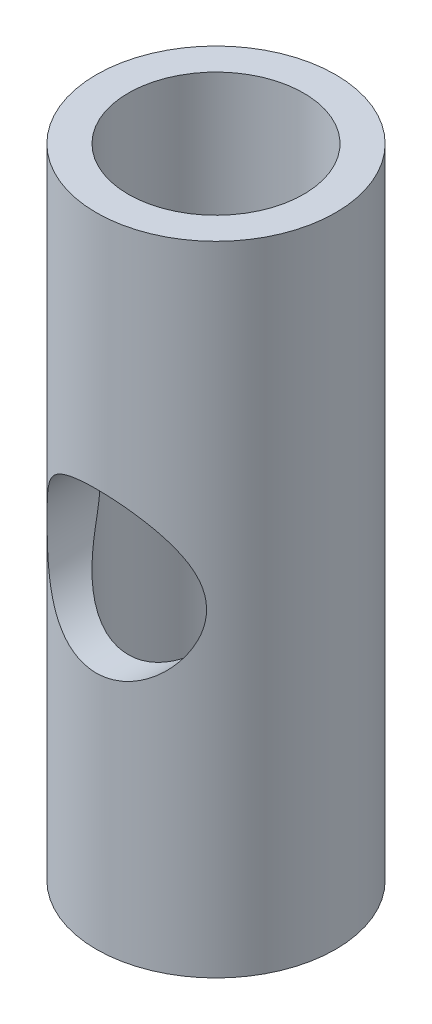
from build123d import *

# Parameters (mm, degrees)
SKETCH1_R          = 1.5
SKETCH1_R_2        = 1.1
EXTRUDE1_DEPTH     = 8
SKETCH2_R          = 1
CUT_EXTRUDE1_DEPTH = 9.276472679


with BuildPart() as part:
    # Sketch1 → Extrude1 (new body)
    with BuildSketch(Plane(origin=(0, 0, 0), x_dir=(1, 0, 0), z_dir=(0, 1, 0))):
        with Locations(Location((0, 0, 0), (0, 0, 270))):
            Circle(SKETCH1_R)
        with Locations(Location((0, 0, 0), (0, 0, 270))):
            Circle(SKETCH1_R_2, mode=Mode.SUBTRACT)
    extrude(amount=EXTRUDE1_DEPTH)

    # Sketch2 → Cut-Extrude1 (cut, through all)
    with BuildSketch(Plane.XY):
        with Locations(Location((0, 4, 0), (0, 0, 90.000000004))):
            Circle(SKETCH2_R)
    extrude(amount=CUT_EXTRUDE1_DEPTH, mode=Mode.SUBTRACT)


solid = part.part
